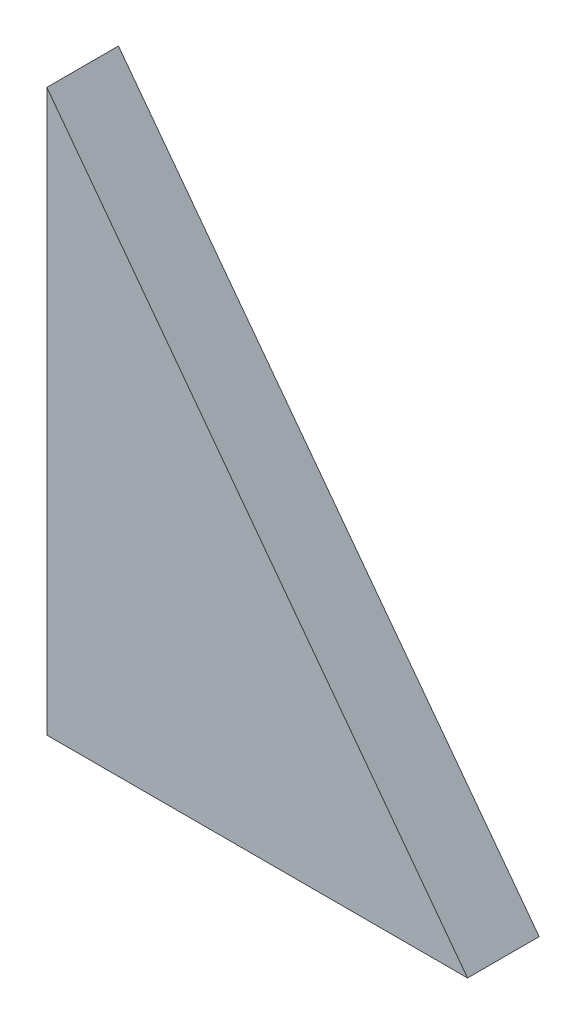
ISO-10303-21;
HEADER;
FILE_DESCRIPTION(('STEP AP214'),'2;1');
FILE_NAME('part.step','',(''),(''),'','','');
FILE_SCHEMA(('AUTOMOTIVE_DESIGN { 1 0 10303 214 1 1 1 1 }'));
ENDSEC;
DATA;
#1=APPLICATION_CONTEXT('core data for automotive mechanical design processes');
#2=APPLICATION_PROTOCOL_DEFINITION('international standard','automotive_design',2000,#1);
#3=PRODUCT_CONTEXT('',#1,'mechanical');
#4=PRODUCT('Part','Part','',(#3));
#5=PRODUCT_RELATED_PRODUCT_CATEGORY('part','',(#4));
#6=PRODUCT_DEFINITION_FORMATION('','',#4);
#7=PRODUCT_DEFINITION_CONTEXT('part definition',#1,'design');
#8=PRODUCT_DEFINITION('design','',#6,#7);
#9=PRODUCT_DEFINITION_SHAPE('','',#8);
#10=(LENGTH_UNIT() NAMED_UNIT(*) SI_UNIT(.MILLI.,.METRE.));
#11=(NAMED_UNIT(*) PLANE_ANGLE_UNIT() SI_UNIT($,.RADIAN.));
#12=(NAMED_UNIT(*) SI_UNIT($,.STERADIAN.) SOLID_ANGLE_UNIT());
#13=UNCERTAINTY_MEASURE_WITH_UNIT(LENGTH_MEASURE(1.E-05),#10,'distance_accuracy_value','');
#14=(GEOMETRIC_REPRESENTATION_CONTEXT(3) GLOBAL_UNCERTAINTY_ASSIGNED_CONTEXT((#13)) GLOBAL_UNIT_ASSIGNED_CONTEXT((#10,
#11,#12)) REPRESENTATION_CONTEXT('',''));
#15=CARTESIAN_POINT('',(0.,0.,0.));
#16=DIRECTION('',(0.,0.,1.));
#17=DIRECTION('',(1.,0.,0.));
#18=AXIS2_PLACEMENT_3D('',#15,#16,#17);
#19=CARTESIAN_POINT('',(74.5999142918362,0.,12.7));
#20=DIRECTION('',(-0.800020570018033,-0.599972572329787,0.));
#21=DIRECTION('',(0.599972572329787,-0.800020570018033,0.));
#22=AXIS2_PLACEMENT_3D('',#19,#20,#21);
#23=PLANE('',#22);
#24=DIRECTION('',(-0.599972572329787,0.800020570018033,0.));
#25=VECTOR('',#24,1.);
#26=CARTESIAN_POINT('',(74.5999142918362,0.,0.));
#27=LINE('',#26,#25);
#28=CARTESIAN_POINT('',(74.5999142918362,0.,0.));
#29=VERTEX_POINT('',#28);
#30=CARTESIAN_POINT('',(0.,99.4736571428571,0.));
#31=VERTEX_POINT('',#30);
#32=EDGE_CURVE('E80',#29,#31,#27,.T.);
#33=ORIENTED_EDGE('',*,*,#32,.T.);
#34=DIRECTION('',(0.,0.,-1.));
#35=VECTOR('',#34,1.);
#36=CARTESIAN_POINT('',(0.,99.4736571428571,12.7));
#37=LINE('',#36,#35);
#38=CARTESIAN_POINT('',(0.,99.4736571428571,12.7));
#39=VERTEX_POINT('',#38);
#40=EDGE_CURVE('E11',#39,#31,#37,.T.);
#41=ORIENTED_EDGE('',*,*,#40,.F.);
#42=DIRECTION('',(-0.599972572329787,0.800020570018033,0.));
#43=VECTOR('',#42,1.);
#44=CARTESIAN_POINT('',(74.5999142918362,0.,12.7));
#45=LINE('',#44,#43);
#46=CARTESIAN_POINT('',(74.5999142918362,0.,12.7));
#47=VERTEX_POINT('',#46);
#48=EDGE_CURVE('E73',#47,#39,#45,.T.);
#49=ORIENTED_EDGE('',*,*,#48,.F.);
#50=DIRECTION('',(0.,0.,-1.));
#51=VECTOR('',#50,1.);
#52=CARTESIAN_POINT('',(74.5999142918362,0.,12.7));
#53=LINE('',#52,#51);
#54=EDGE_CURVE('E81',#47,#29,#53,.T.);
#55=ORIENTED_EDGE('',*,*,#54,.T.);
#56=EDGE_LOOP('',(#33,#41,#49,#55));
#57=FACE_BOUND('',#56,.T.);
#58=ADVANCED_FACE('F33',(#57),#23,.F.);
#59=CARTESIAN_POINT('',(0.,99.4736571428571,12.7));
#60=DIRECTION('',(1.,0.,0.));
#61=DIRECTION('',(0.,1.,0.));
#62=AXIS2_PLACEMENT_3D('',#59,#60,#61);
#63=PLANE('',#62);
#64=DIRECTION('',(0.,-1.,0.));
#65=VECTOR('',#64,1.);
#66=CARTESIAN_POINT('',(0.,99.4736571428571,0.));
#67=LINE('',#66,#65);
#68=CARTESIAN_POINT('',(0.,0.,0.));
#69=VERTEX_POINT('',#68);
#70=EDGE_CURVE('E61',#31,#69,#67,.T.);
#71=ORIENTED_EDGE('',*,*,#70,.T.);
#72=DIRECTION('',(0.,0.,-1.));
#73=VECTOR('',#72,1.);
#74=CARTESIAN_POINT('',(0.,0.,12.7));
#75=LINE('',#74,#73);
#76=CARTESIAN_POINT('',(0.,0.,12.7));
#77=VERTEX_POINT('',#76);
#78=EDGE_CURVE('E41',#77,#69,#75,.T.);
#79=ORIENTED_EDGE('',*,*,#78,.F.);
#80=DIRECTION('',(0.,-1.,0.));
#81=VECTOR('',#80,1.);
#82=CARTESIAN_POINT('',(0.,99.4736571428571,12.7));
#83=LINE('',#82,#81);
#84=EDGE_CURVE('E69',#39,#77,#83,.T.);
#85=ORIENTED_EDGE('',*,*,#84,.F.);
#86=ORIENTED_EDGE('',*,*,#40,.T.);
#87=EDGE_LOOP('',(#71,#79,#85,#86));
#88=FACE_BOUND('',#87,.T.);
#89=ADVANCED_FACE('F70',(#88),#63,.F.);
#90=CARTESIAN_POINT('',(74.5999142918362,0.,12.7));
#91=DIRECTION('',(0.,1.,0.));
#92=DIRECTION('',(-1.,0.,0.));
#93=AXIS2_PLACEMENT_3D('',#90,#91,#92);
#94=PLANE('',#93);
#95=DIRECTION('',(1.,0.,0.));
#96=VECTOR('',#95,1.);
#97=CARTESIAN_POINT('',(74.5999142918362,0.,0.));
#98=LINE('',#97,#96);
#99=EDGE_CURVE('E66',#69,#29,#98,.T.);
#100=ORIENTED_EDGE('',*,*,#99,.T.);
#101=ORIENTED_EDGE('',*,*,#54,.F.);
#102=DIRECTION('',(1.,0.,0.));
#103=VECTOR('',#102,1.);
#104=CARTESIAN_POINT('',(74.5999142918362,0.,12.7));
#105=LINE('',#104,#103);
#106=EDGE_CURVE('E49',#77,#47,#105,.T.);
#107=ORIENTED_EDGE('',*,*,#106,.F.);
#108=ORIENTED_EDGE('',*,*,#78,.T.);
#109=EDGE_LOOP('',(#100,#101,#107,#108));
#110=FACE_BOUND('',#109,.T.);
#111=ADVANCED_FACE('F88',(#110),#94,.F.);
#112=CARTESIAN_POINT('',(74.5999142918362,0.,12.7));
#113=DIRECTION('',(0.,0.,1.));
#114=DIRECTION('',(1.,0.,0.));
#115=AXIS2_PLACEMENT_3D('',#112,#113,#114);
#116=PLANE('',#115);
#117=ORIENTED_EDGE('',*,*,#48,.T.);
#118=ORIENTED_EDGE('',*,*,#84,.T.);
#119=ORIENTED_EDGE('',*,*,#106,.T.);
#120=EDGE_LOOP('',(#117,#118,#119));
#121=FACE_BOUND('',#120,.T.);
#122=ADVANCED_FACE('F76',(#121),#116,.T.);
#123=CARTESIAN_POINT('',(74.5999142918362,0.,0.));
#124=DIRECTION('',(0.,0.,1.));
#125=DIRECTION('',(1.,0.,0.));
#126=AXIS2_PLACEMENT_3D('',#123,#124,#125);
#127=PLANE('',#126);
#128=ORIENTED_EDGE('',*,*,#32,.F.);
#129=ORIENTED_EDGE('',*,*,#99,.F.);
#130=ORIENTED_EDGE('',*,*,#70,.F.);
#131=EDGE_LOOP('',(#128,#129,#130));
#132=FACE_BOUND('',#131,.T.);
#133=ADVANCED_FACE('F89',(#132),#127,.F.);
#134=CLOSED_SHELL('',(#58,#89,#111,#122,#133));
#135=MANIFOLD_SOLID_BREP('B2',#134);
#136=ADVANCED_BREP_SHAPE_REPRESENTATION('',(#18,#135),#14);
#137=SHAPE_DEFINITION_REPRESENTATION(#9,#136);
ENDSEC;
END-ISO-10303-21;
